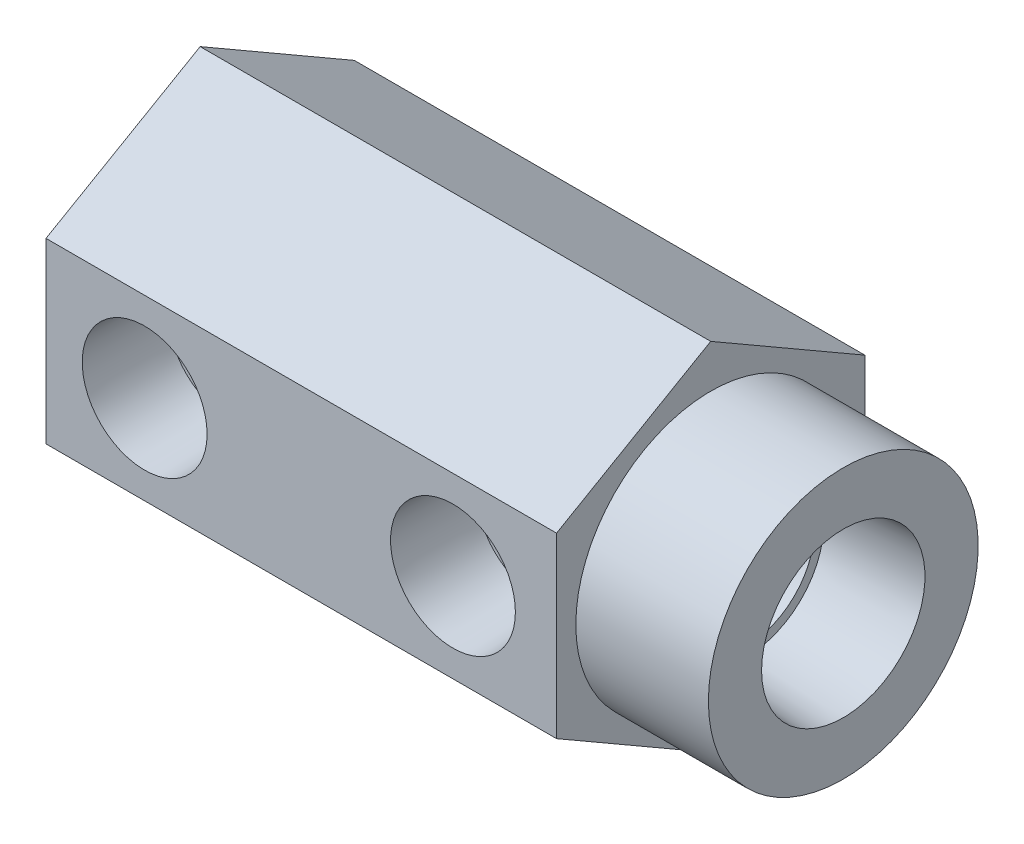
ISO-10303-21;
HEADER;
FILE_DESCRIPTION(('STEP AP214'),'2;1');
FILE_NAME('part.step','',(''),(''),'','','');
FILE_SCHEMA(('AUTOMOTIVE_DESIGN { 1 0 10303 214 1 1 1 1 }'));
ENDSEC;
DATA;
#1=APPLICATION_CONTEXT('core data for automotive mechanical design processes');
#2=APPLICATION_PROTOCOL_DEFINITION('international standard','automotive_design',2000,#1);
#3=PRODUCT_CONTEXT('',#1,'mechanical');
#4=PRODUCT('Part','Part','',(#3));
#5=PRODUCT_RELATED_PRODUCT_CATEGORY('part','',(#4));
#6=PRODUCT_DEFINITION_FORMATION('','',#4);
#7=PRODUCT_DEFINITION_CONTEXT('part definition',#1,'design');
#8=PRODUCT_DEFINITION('design','',#6,#7);
#9=PRODUCT_DEFINITION_SHAPE('','',#8);
#10=(LENGTH_UNIT() NAMED_UNIT(*) SI_UNIT(.MILLI.,.METRE.));
#11=(NAMED_UNIT(*) PLANE_ANGLE_UNIT() SI_UNIT($,.RADIAN.));
#12=(NAMED_UNIT(*) SI_UNIT($,.STERADIAN.) SOLID_ANGLE_UNIT());
#13=UNCERTAINTY_MEASURE_WITH_UNIT(LENGTH_MEASURE(1.E-05),#10,'distance_accuracy_value','');
#14=(GEOMETRIC_REPRESENTATION_CONTEXT(3) GLOBAL_UNCERTAINTY_ASSIGNED_CONTEXT((#13)) GLOBAL_UNIT_ASSIGNED_CONTEXT((#10,
#11,#12)) REPRESENTATION_CONTEXT('',''));
#15=CARTESIAN_POINT('',(0.,0.,0.));
#16=DIRECTION('',(0.,0.,1.));
#17=DIRECTION('',(1.,0.,0.));
#18=AXIS2_PLACEMENT_3D('',#15,#16,#17);
#19=CARTESIAN_POINT('',(52.9844,0.,0.));
#20=DIRECTION('',(1.,0.,0.));
#21=DIRECTION('',(0.,0.,-1.));
#22=AXIS2_PLACEMENT_3D('',#19,#20,#21);
#23=CYLINDRICAL_SURFACE('',#22,3.17499999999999);
#24=CARTESIAN_POINT('',(21.2344,0.,0.));
#25=DIRECTION('',(1.,0.,0.));
#26=DIRECTION('',(0.,0.,-1.));
#27=AXIS2_PLACEMENT_3D('',#24,#25,#26);
#28=CIRCLE('',#27,3.17499999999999);
#29=CARTESIAN_POINT('',(21.2344,0.,-3.17499999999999));
#30=VERTEX_POINT('',#29);
#31=EDGE_CURVE('E144',#30,#30,#28,.T.);
#32=ORIENTED_EDGE('',*,*,#31,.F.);
#33=EDGE_LOOP('',(#32));
#34=FACE_BOUND('',#33,.T.);
#35=CARTESIAN_POINT('',(27.5844,0.,0.));
#36=DIRECTION('',(1.,0.,0.));
#37=DIRECTION('',(0.,0.,-1.));
#38=AXIS2_PLACEMENT_3D('',#35,#36,#37);
#39=CIRCLE('',#38,3.17499999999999);
#40=CARTESIAN_POINT('',(27.5844,0.,-3.17499999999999));
#41=VERTEX_POINT('',#40);
#42=EDGE_CURVE('E38',#41,#41,#39,.F.);
#43=ORIENTED_EDGE('',*,*,#42,.F.);
#44=EDGE_LOOP('',(#43));
#45=FACE_BOUND('',#44,.T.);
#46=ADVANCED_FACE('F34',(#34,#45),#23,.F.);
#47=CARTESIAN_POINT('',(33.528,0.,12.7));
#48=DIRECTION('',(0.,0.,1.));
#49=DIRECTION('',(1.,0.,0.));
#50=AXIS2_PLACEMENT_3D('',#47,#48,#49);
#51=CYLINDRICAL_SURFACE('',#50,4.2164);
#52=CARTESIAN_POINT('',(33.528,0.,5.77596));
#53=DIRECTION('',(0.,0.,1.));
#54=DIRECTION('',(1.,0.,0.));
#55=AXIS2_PLACEMENT_3D('',#52,#53,#54);
#56=CIRCLE('',#55,4.2164);
#57=CARTESIAN_POINT('',(37.7444,0.,5.77596));
#58=VERTEX_POINT('',#57);
#59=EDGE_CURVE('E282',#58,#58,#56,.T.);
#60=ORIENTED_EDGE('',*,*,#59,.T.);
#61=EDGE_LOOP('',(#60));
#62=FACE_BOUND('',#61,.T.);
#63=CARTESIAN_POINT('',(37.7444,0.,5.54990000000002));
#64=CARTESIAN_POINT('',(37.7443993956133,0.102666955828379,5.54989942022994));
#65=CARTESIAN_POINT('',(37.7406438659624,0.205343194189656,5.54704470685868));
#66=CARTESIAN_POINT('',(37.7256842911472,0.409877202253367,5.53569249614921));
#67=CARTESIAN_POINT('',(37.7144766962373,0.511734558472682,5.52719230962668));
#68=CARTESIAN_POINT('',(37.6847756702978,0.713930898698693,5.50472974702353));
#69=CARTESIAN_POINT('',(37.6662712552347,0.814267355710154,5.49075913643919));
#70=CARTESIAN_POINT('',(37.6222775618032,1.01254840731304,5.45767930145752));
#71=CARTESIAN_POINT('',(37.5967851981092,1.11049192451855,5.43856780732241));
#72=CARTESIAN_POINT('',(37.5107274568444,1.398497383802,5.37438339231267));
#73=CARTESIAN_POINT('',(37.440361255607,1.58418379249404,5.32229076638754));
#74=CARTESIAN_POINT('',(37.276841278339,1.93974746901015,5.2032718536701));
#75=CARTESIAN_POINT('',(37.1836912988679,2.10962736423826,5.1363480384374));
#76=CARTESIAN_POINT('',(36.9680945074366,2.44693461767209,4.98509307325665));
#77=CARTESIAN_POINT('',(36.8437265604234,2.61265837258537,4.89972096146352));
#78=CARTESIAN_POINT('',(36.5743774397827,2.92229860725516,4.72159970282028));
#79=CARTESIAN_POINT('',(36.4293655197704,3.06618188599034,4.62883964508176));
#80=CARTESIAN_POINT('',(36.1818679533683,3.27873581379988,4.47894046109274));
#81=CARTESIAN_POINT('',(36.0852396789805,3.35465016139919,4.4222195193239));
#82=CARTESIAN_POINT('',(35.8853172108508,3.49803153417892,4.30969399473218));
#83=CARTESIAN_POINT('',(35.7820209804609,3.56549595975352,4.25388969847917));
#84=CARTESIAN_POINT('',(35.5689644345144,3.69158445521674,4.14494021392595));
#85=CARTESIAN_POINT('',(35.459210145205,3.75021659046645,4.091792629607));
#86=CARTESIAN_POINT('',(35.2332788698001,3.85820397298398,3.99013143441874));
#87=CARTESIAN_POINT('',(35.1171056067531,3.90756452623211,3.94161518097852));
#88=CARTESIAN_POINT('',(34.8423535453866,4.00972513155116,3.83800214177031));
#89=CARTESIAN_POINT('',(34.6815147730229,4.05910874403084,3.78530268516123));
#90=CARTESIAN_POINT('',(34.4334747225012,4.11890503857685,3.71979682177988));
#91=CARTESIAN_POINT('',(34.3497154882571,4.13645117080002,3.70022626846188));
#92=CARTESIAN_POINT('',(34.1802742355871,4.16652842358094,3.66632583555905));
#93=CARTESIAN_POINT('',(34.0945932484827,4.17906216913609,3.65199321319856));
#94=CARTESIAN_POINT('',(33.9209530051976,4.19896788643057,3.62908998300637));
#95=CARTESIAN_POINT('',(33.8329793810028,4.2062854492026,3.62058014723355));
#96=CARTESIAN_POINT('',(33.6563570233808,4.2153732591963,3.60999553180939));
#97=CARTESIAN_POINT('',(33.5677083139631,4.21714370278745,3.60792052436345));
#98=CARTESIAN_POINT('',(33.3905433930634,4.21508975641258,3.61032018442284));
#99=CARTESIAN_POINT('',(33.3020272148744,4.21126414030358,3.61479628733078));
#100=CARTESIAN_POINT('',(33.1259748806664,4.1981195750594,3.63005192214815));
#101=CARTESIAN_POINT('',(33.038438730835,4.18880059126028,3.64083149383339));
#102=CARTESIAN_POINT('',(32.7985166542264,4.15568903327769,3.67868158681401));
#103=CARTESIAN_POINT('',(32.6478348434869,4.1262776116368,3.71190594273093));
#104=CARTESIAN_POINT('',(32.3540921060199,4.05253036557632,3.79227022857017));
#105=CARTESIAN_POINT('',(32.211039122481,4.00817932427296,3.83942434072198));
#106=CARTESIAN_POINT('',(31.9583831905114,3.91523448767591,3.93394303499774));
#107=CARTESIAN_POINT('',(31.847374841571,3.86881960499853,3.97976043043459));
#108=CARTESIAN_POINT('',(31.6311954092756,3.7675481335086,4.07576238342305));
#109=CARTESIAN_POINT('',(31.5260274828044,3.71268703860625,4.12594926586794));
#110=CARTESIAN_POINT('',(31.3214051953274,3.5948485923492,4.22901830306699));
#111=CARTESIAN_POINT('',(31.2219633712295,3.53185434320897,4.28190592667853));
#112=CARTESIAN_POINT('',(31.0290973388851,3.39812936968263,4.38878526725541));
#113=CARTESIAN_POINT('',(30.9356721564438,3.32739990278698,4.44277680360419));
#114=CARTESIAN_POINT('',(30.7523590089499,3.17621734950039,4.55214005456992));
#115=CARTESIAN_POINT('',(30.662649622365,3.09554338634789,4.60750688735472));
#116=CARTESIAN_POINT('',(30.4900225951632,2.92631985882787,4.7168012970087));
#117=CARTESIAN_POINT('',(30.4071076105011,2.83776724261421,4.77072830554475));
#118=CARTESIAN_POINT('',(30.1695373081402,2.56081846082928,4.92833957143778));
#119=CARTESIAN_POINT('',(30.0255232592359,2.36069403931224,5.02818332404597));
#120=CARTESIAN_POINT('',(29.79622654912,1.97290355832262,5.19079382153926));
#121=CARTESIAN_POINT('',(29.704976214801,1.79022627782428,5.25699864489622));
#122=CARTESIAN_POINT('',(29.5877201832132,1.50428240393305,5.34307696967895));
#123=CARTESIAN_POINT('',(29.5518975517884,1.40695118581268,5.36957042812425));
#124=CARTESIAN_POINT('',(29.487255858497,1.20882529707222,5.41761054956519));
#125=CARTESIAN_POINT('',(29.4584337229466,1.10803216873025,5.43915938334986));
#126=CARTESIAN_POINT('',(29.4080388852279,0.902877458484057,5.47696644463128));
#127=CARTESIAN_POINT('',(29.3865198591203,0.798495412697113,5.49318547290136));
#128=CARTESIAN_POINT('',(29.3513945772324,0.587711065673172,5.5197156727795));
#129=CARTESIAN_POINT('',(29.3377846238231,0.481309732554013,5.53002960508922));
#130=CARTESIAN_POINT('',(29.3187165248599,0.267379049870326,5.54449183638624));
#131=CARTESIAN_POINT('',(29.3132569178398,0.159849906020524,5.54864124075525));
#132=CARTESIAN_POINT('',(29.31059043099,-0.0553630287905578,5.55066695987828));
#133=CARTESIAN_POINT('',(29.3133828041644,-0.163046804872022,5.54854384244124));
#134=CARTESIAN_POINT('',(29.3264157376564,-0.365919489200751,5.53865106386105));
#135=CARTESIAN_POINT('',(29.3358141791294,-0.461194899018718,5.5315198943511));
#136=CARTESIAN_POINT('',(29.3609746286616,-0.65042738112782,5.51247648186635));
#137=CARTESIAN_POINT('',(29.3767386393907,-0.744384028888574,5.50056273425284));
#138=CARTESIAN_POINT('',(29.4332697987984,-1.02327908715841,5.4579792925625));
#139=CARTESIAN_POINT('',(29.4832871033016,-1.20540685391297,5.42045882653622));
#140=CARTESIAN_POINT('',(29.6070842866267,-1.56242729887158,5.32871242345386));
#141=CARTESIAN_POINT('',(29.6814572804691,-1.73700152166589,5.27407116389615));
#142=CARTESIAN_POINT('',(29.8505450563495,-2.07109183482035,5.15204916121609));
#143=CARTESIAN_POINT('',(29.9452628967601,-2.23060565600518,5.08466650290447));
#144=CARTESIAN_POINT('',(30.1694079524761,-2.55802504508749,4.92909083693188));
#145=CARTESIAN_POINT('',(30.3019810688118,-2.72300325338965,4.83929765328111));
#146=CARTESIAN_POINT('',(30.5883037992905,-3.02991540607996,4.65330404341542));
#147=CARTESIAN_POINT('',(30.7420960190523,-3.17180170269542,4.55709093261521));
#148=CARTESIAN_POINT('',(31.0034639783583,-3.3794070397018,4.40345363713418));
#149=CARTESIAN_POINT('',(31.1049126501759,-3.45288781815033,4.34591141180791));
#150=CARTESIAN_POINT('',(31.314685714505,-3.5909673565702,4.23253042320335));
#151=CARTESIAN_POINT('',(31.4230125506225,-3.65556293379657,4.17669227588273));
#152=CARTESIAN_POINT('',(31.6462598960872,-3.7753266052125,4.06875742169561));
#153=CARTESIAN_POINT('',(31.7611678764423,-3.83051186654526,4.01665400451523));
#154=CARTESIAN_POINT('',(31.9975785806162,-3.93094643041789,3.91841531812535));
#155=CARTESIAN_POINT('',(32.1190762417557,-3.97620322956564,3.87227555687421));
#156=CARTESIAN_POINT('',(32.3974988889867,-4.06520982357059,3.77896121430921));
#157=CARTESIAN_POINT('',(32.5561211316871,-4.10619306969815,3.7340128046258));
#158=CARTESIAN_POINT('',(32.7996105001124,-4.15383268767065,3.68070998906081));
#159=CARTESIAN_POINT('',(32.8816471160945,-4.16740255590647,3.66530086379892));
#160=CARTESIAN_POINT('',(33.0471718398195,-4.18972486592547,3.63976459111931));
#161=CARTESIAN_POINT('',(33.1306592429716,-4.19847958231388,3.62963494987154));
#162=CARTESIAN_POINT('',(33.2991320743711,-4.21103758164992,3.61505835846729));
#163=CARTESIAN_POINT('',(33.3841240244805,-4.21480358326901,3.6106542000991));
#164=CARTESIAN_POINT('',(33.5542775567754,-4.21717640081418,3.60788260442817));
#165=CARTESIAN_POINT('',(33.639439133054,-4.21578339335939,3.60951496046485));
#166=CARTESIAN_POINT('',(33.8092521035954,-4.20786839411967,3.61873867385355));
#167=CARTESIAN_POINT('',(33.8939031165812,-4.20134295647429,3.62633403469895));
#168=CARTESIAN_POINT('',(34.0620056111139,-4.18330254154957,3.64713005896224));
#169=CARTESIAN_POINT('',(34.1454564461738,-4.17178497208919,3.66033363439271));
#170=CARTESIAN_POINT('',(34.3240534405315,-4.1417155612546,3.69434379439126));
#171=CARTESIAN_POINT('',(34.4188890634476,-4.12232321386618,3.71603879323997));
#172=CARTESIAN_POINT('',(34.6056232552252,-4.07749843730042,3.7651699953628));
#173=CARTESIAN_POINT('',(34.697519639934,-4.05206162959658,3.79261035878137));
#174=CARTESIAN_POINT('',(34.9685718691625,-3.96719813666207,3.88193715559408));
#175=CARTESIAN_POINT('',(35.1428493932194,-3.89926066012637,3.95077814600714));
#176=CARTESIAN_POINT('',(35.426054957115,-3.76720881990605,4.07616702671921));
#177=CARTESIAN_POINT('',(35.5387046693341,-3.70824622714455,4.13006200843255));
#178=CARTESIAN_POINT('',(35.7572672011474,-3.5811127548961,4.24076863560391));
#179=CARTESIAN_POINT('',(35.8631775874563,-3.51293857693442,4.29758132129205));
#180=CARTESIAN_POINT('',(36.0681950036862,-3.36767607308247,4.41233843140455));
#181=CARTESIAN_POINT('',(36.167295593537,-3.29057948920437,4.47028386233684));
#182=CARTESIAN_POINT('',(36.3583871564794,-3.12772920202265,4.58570164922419));
#183=CARTESIAN_POINT('',(36.450379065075,-3.04197664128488,4.64317406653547));
#184=CARTESIAN_POINT('',(36.6281804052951,-2.86064113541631,4.75707411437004));
#185=CARTESIAN_POINT('',(36.7138800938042,-2.76493305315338,4.81347428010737));
#186=CARTESIAN_POINT('',(36.8770160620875,-2.56491197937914,4.9229681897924));
#187=CARTESIAN_POINT('',(36.954451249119,-2.46059785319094,4.9760614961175));
#188=CARTESIAN_POINT('',(37.100127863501,-2.24386878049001,5.07747289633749));
#189=CARTESIAN_POINT('',(37.1683863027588,-2.13146943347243,5.12579978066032));
#190=CARTESIAN_POINT('',(37.29491910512,-1.89890802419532,5.21642520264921));
#191=CARTESIAN_POINT('',(37.3531981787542,-1.77874966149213,5.25872658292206));
#192=CARTESIAN_POINT('',(37.4439058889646,-1.56622364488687,5.32513054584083));
#193=CARTESIAN_POINT('',(37.4789964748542,-1.47553606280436,5.35100662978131));
#194=CARTESIAN_POINT('',(37.5430944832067,-1.29096184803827,5.39850728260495));
#195=CARTESIAN_POINT('',(37.5721033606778,-1.19707598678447,5.420132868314));
#196=CARTESIAN_POINT('',(37.6236159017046,-1.00680382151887,5.4586756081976));
#197=CARTESIAN_POINT('',(37.6461329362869,-0.910423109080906,5.47560243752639));
#198=CARTESIAN_POINT('',(37.6844114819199,-0.715624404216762,5.50444899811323));
#199=CARTESIAN_POINT('',(37.700175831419,-0.61720728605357,5.5163708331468));
#200=CARTESIAN_POINT('',(37.7230526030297,-0.432452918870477,5.53369497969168));
#201=CARTESIAN_POINT('',(37.7310480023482,-0.34628607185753,5.53976185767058));
#202=CARTESIAN_POINT('',(37.7417225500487,-0.173415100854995,5.54786506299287));
#203=CARTESIAN_POINT('',(37.7444005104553,-0.0867108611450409,5.54990048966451));
#204=CARTESIAN_POINT('',(37.7444,0.,5.54990000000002));
#205=B_SPLINE_CURVE_WITH_KNOTS('',3,(#63,#64,#65,#66,#67,#68,#69,#70,#71,#72,#73,#74,#75,#76,
#77,#78,#79,#80,#81,#82,#83,#84,#85,#86,#87,#88,#89,#90,#91,#92,#93,#94,#95,#96,#97,#98,#99,
#100,#101,#102,#103,#104,#105,#106,#107,#108,#109,#110,#111,#112,#113,#114,#115,#116,#117,#118,
#119,#120,#121,#122,#123,#124,#125,#126,#127,#128,#129,#130,#131,#132,#133,#134,#135,#136,#137,
#138,#139,#140,#141,#142,#143,#144,#145,#146,#147,#148,#149,#150,#151,#152,#153,#154,#155,#156,
#157,#158,#159,#160,#161,#162,#163,#164,#165,#166,#167,#168,#169,#170,#171,#172,#173,#174,#175,
#176,#177,#178,#179,#180,#181,#182,#183,#184,#185,#186,#187,#188,#189,#190,#191,#192,#193,#194,
#195,#196,#197,#198,#199,#200,#201,#202,#203,#204),.UNSPECIFIED.,.T.,.F.,(4,2,2,2,2,2,2,2,2,2,2,
2,2,2,2,2,2,2,2,2,2,2,2,2,2,2,2,2,2,2,2,2,2,2,2,2,2,2,2,2,2,2,2,2,2,2,2,2,2,2,2,2,2,2,2,2,2,2,2,
2,2,2,2,2,2,2,2,2,2,2,4),(0.,0.307909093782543,0.615964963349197,0.924486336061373,
1.23314414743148,1.84608968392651,2.45893315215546,3.12888302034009,3.79984133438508,
4.20549409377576,4.61127134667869,5.01667578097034,5.42184749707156,5.94866107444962,
6.21175949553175,6.47471995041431,6.74038467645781,7.00603999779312,7.2717535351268,
7.53746874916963,8.00678580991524,8.47658235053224,8.86232249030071,9.24826914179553,
9.63503095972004,10.0217299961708,10.4195319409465,10.817488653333,11.6111347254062,
12.2523588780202,12.5731486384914,12.8937972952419,13.2167540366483,13.5395596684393,
13.8623074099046,14.1850259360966,14.4726847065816,14.7604340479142,15.3354443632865,
15.925652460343,16.5159493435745,17.2032337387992,17.891918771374,18.3050679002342,
18.7183646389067,19.1308991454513,19.543121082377,20.0506303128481,20.3040712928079,
20.5573924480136,20.8125962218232,21.0677912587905,21.323157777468,21.5786570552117,
21.8757972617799,22.1731533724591,22.7686074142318,23.1824806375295,23.5965024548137,
24.0109105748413,24.4252640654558,24.8456610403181,25.266113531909,25.6857755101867,
26.1052388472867,26.4068178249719,26.7083245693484,27.0092058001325,27.3099604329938,
27.5699574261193,27.8300124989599),.UNSPECIFIED.);
#206=CARTESIAN_POINT('',(37.7444,0.,5.54990000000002));
#207=VERTEX_POINT('',#206);
#208=EDGE_CURVE('E155',#207,#207,#205,.T.);
#209=ORIENTED_EDGE('',*,*,#208,.F.);
#210=EDGE_LOOP('',(#209));
#211=FACE_BOUND('',#210,.T.);
#212=ADVANCED_FACE('F186',(#62,#211),#51,.F.);
#213=CARTESIAN_POINT('',(52.9844,0.,0.));
#214=DIRECTION('',(1.,0.,0.));
#215=DIRECTION('',(0.,0.,-1.));
#216=AXIS2_PLACEMENT_3D('',#213,#214,#215);
#217=PLANE('',#216);
#218=CARTESIAN_POINT('',(52.9844,0.,0.));
#219=DIRECTION('',(1.,0.,0.));
#220=DIRECTION('',(0.,0.,-1.));
#221=AXIS2_PLACEMENT_3D('',#218,#219,#220);
#222=CIRCLE('',#221,11.1125);
#223=CARTESIAN_POINT('',(52.9844,0.,11.1125));
#224=VERTEX_POINT('',#223);
#225=EDGE_CURVE('E275',#224,#224,#222,.T.);
#226=ORIENTED_EDGE('',*,*,#225,.T.);
#227=EDGE_LOOP('',(#226));
#228=FACE_BOUND('',#227,.T.);
#229=CARTESIAN_POINT('',(52.9844,0.,0.));
#230=DIRECTION('',(-1.,0.,0.));
#231=DIRECTION('',(0.,0.,1.));
#232=AXIS2_PLACEMENT_3D('',#229,#230,#231);
#233=CIRCLE('',#232,6.73100000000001);
#234=CARTESIAN_POINT('',(52.9844,0.,6.73100000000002));
#235=VERTEX_POINT('',#234);
#236=EDGE_CURVE('E307',#235,#235,#233,.T.);
#237=ORIENTED_EDGE('',*,*,#236,.T.);
#238=EDGE_LOOP('',(#237));
#239=FACE_BOUND('',#238,.T.);
#240=ADVANCED_FACE('F229',(#228,#239),#217,.T.);
#241=CARTESIAN_POINT('',(21.2344,0.,0.));
#242=DIRECTION('',(1.,0.,0.));
#243=DIRECTION('',(0.,0.,-1.));
#244=AXIS2_PLACEMENT_3D('',#241,#242,#243);
#245=CONICAL_SURFACE('',#244,3.17499999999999,1.02974425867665);
#246=CARTESIAN_POINT('',(20.9959334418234,0.,0.));
#247=DIRECTION('',(1.,0.,0.));
#248=DIRECTION('',(0.,0.,-1.));
#249=AXIS2_PLACEMENT_3D('',#246,#247,#248);
#250=CIRCLE('',#249,2.77812499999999);
#251=CARTESIAN_POINT('',(20.9959334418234,0.,-2.77812499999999));
#252=VERTEX_POINT('',#251);
#253=EDGE_CURVE('E141',#252,#252,#250,.F.);
#254=ORIENTED_EDGE('',*,*,#253,.T.);
#255=EDGE_LOOP('',(#254));
#256=FACE_BOUND('',#255,.T.);
#257=ORIENTED_EDGE('',*,*,#31,.T.);
#258=EDGE_LOOP('',(#257));
#259=FACE_BOUND('',#258,.T.);
#260=ADVANCED_FACE('F234',(#256,#259),#245,.F.);
#261=CARTESIAN_POINT('',(52.9844,0.,0.));
#262=DIRECTION('',(1.,0.,0.));
#263=DIRECTION('',(0.,0.,-1.));
#264=AXIS2_PLACEMENT_3D('',#261,#262,#263);
#265=CYLINDRICAL_SURFACE('',#264,2.77812499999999);
#266=CARTESIAN_POINT('',(12.3444,0.,-2.77812499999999));
#267=CARTESIAN_POINT('',(12.3443955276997,-0.139883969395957,-2.77811997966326));
#268=CARTESIAN_POINT('',(12.3373755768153,-0.279800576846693,-2.76749868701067));
#269=CARTESIAN_POINT('',(12.3099836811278,-0.555187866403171,-2.72565235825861));
#270=CARTESIAN_POINT('',(12.2896031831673,-0.6906556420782,-2.69441412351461));
#271=CARTESIAN_POINT('',(12.2375104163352,-0.952754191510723,-2.61323304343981));
#272=CARTESIAN_POINT('',(12.2058514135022,-1.07942321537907,-2.56337806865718));
#273=CARTESIAN_POINT('',(12.1337605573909,-1.32210407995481,-2.44706908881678));
#274=CARTESIAN_POINT('',(12.0933275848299,-1.4381145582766,-2.38061296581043));
#275=CARTESIAN_POINT('',(12.0029110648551,-1.66718281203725,-2.22689910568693));
#276=CARTESIAN_POINT('',(11.9524106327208,-1.77917454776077,-2.13836318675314));
#277=CARTESIAN_POINT('',(11.8482905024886,-1.98773409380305,-1.94603559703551));
#278=CARTESIAN_POINT('',(11.7946664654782,-2.08427971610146,-1.84222238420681));
#279=CARTESIAN_POINT('',(11.680384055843,-2.27435151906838,-1.60375038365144));
#280=CARTESIAN_POINT('',(11.6199096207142,-2.36513867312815,-1.46680289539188));
#281=CARTESIAN_POINT('',(11.5081634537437,-2.52226630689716,-1.17614753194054));
#282=CARTESIAN_POINT('',(11.4568758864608,-2.58864906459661,-1.0224692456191));
#283=CARTESIAN_POINT('',(11.3845681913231,-2.6786449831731,-0.746661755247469));
#284=CARTESIAN_POINT('',(11.3590896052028,-2.70904686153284,-0.627927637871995));
#285=CARTESIAN_POINT('',(11.3208802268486,-2.75398593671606,-0.385574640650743));
#286=CARTESIAN_POINT('',(11.3081282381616,-2.76854951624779,-0.261964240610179));
#287=CARTESIAN_POINT('',(11.2973346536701,-2.78090423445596,-0.0127670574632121));
#288=CARTESIAN_POINT('',(11.299348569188,-2.77863208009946,0.112825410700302));
#289=CARTESIAN_POINT('',(11.3178791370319,-2.75733196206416,0.361533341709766));
#290=CARTESIAN_POINT('',(11.3344080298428,-2.73828985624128,0.484646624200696));
#291=CARTESIAN_POINT('',(11.3785253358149,-2.68574292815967,0.720261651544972));
#292=CARTESIAN_POINT('',(11.405649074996,-2.65284171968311,0.832990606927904));
#293=CARTESIAN_POINT('',(11.4678512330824,-2.57408907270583,1.05144792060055));
#294=CARTESIAN_POINT('',(11.5029322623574,-2.52823338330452,1.15717396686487));
#295=CARTESIAN_POINT('',(11.5855849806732,-2.41433509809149,1.38122293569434));
#296=CARTESIAN_POINT('',(11.6342504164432,-2.34368656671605,1.49781446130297));
#297=CARTESIAN_POINT('',(11.7342078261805,-2.18677186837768,1.71883915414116));
#298=CARTESIAN_POINT('',(11.7855029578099,-2.10048659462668,1.82325718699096));
#299=CARTESIAN_POINT('',(11.8972440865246,-1.89401186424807,2.0389531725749));
#300=CARTESIAN_POINT('',(11.9574048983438,-1.77049887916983,2.14723280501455));
#301=CARTESIAN_POINT('',(12.0697093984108,-1.50393214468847,2.3416440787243));
#302=CARTESIAN_POINT('',(12.1218609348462,-1.360897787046,2.42779745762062));
#303=CARTESIAN_POINT('',(12.2035712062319,-1.08804954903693,2.55975410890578));
#304=CARTESIAN_POINT('',(12.2355572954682,-0.961193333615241,2.61016446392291));
#305=CARTESIAN_POINT('',(12.2881429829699,-0.699302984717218,2.69216201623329));
#306=CARTESIAN_POINT('',(12.3087520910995,-0.564275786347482,2.72376493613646));
#307=CARTESIAN_POINT('',(12.3367594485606,-0.289077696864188,2.76656311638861));
#308=CARTESIAN_POINT('',(12.3441045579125,-0.148888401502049,2.77767629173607));
#309=CARTESIAN_POINT('',(12.3446777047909,0.131592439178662,2.77854678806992));
#310=CARTESIAN_POINT('',(12.3379061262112,0.271883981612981,2.76830468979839));
#311=CARTESIAN_POINT('',(12.3118222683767,0.53898974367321,2.72846498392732));
#312=CARTESIAN_POINT('',(12.293354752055,0.666086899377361,2.70017031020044));
#313=CARTESIAN_POINT('',(12.2462164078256,0.913332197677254,2.62686914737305));
#314=CARTESIAN_POINT('',(12.2175439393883,1.03347921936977,2.58185997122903));
#315=CARTESIAN_POINT('',(12.1499536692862,1.27211922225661,2.47345398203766));
#316=CARTESIAN_POINT('',(12.1104913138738,1.38999773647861,2.40905262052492));
#317=CARTESIAN_POINT('',(12.0252151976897,1.61372348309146,2.26530005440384));
#318=CARTESIAN_POINT('',(11.9793972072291,1.7195626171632,2.18593888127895));
#319=CARTESIAN_POINT('',(11.8769809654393,1.93374575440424,2.00042955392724));
#320=CARTESIAN_POINT('',(11.819819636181,2.03987372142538,1.89203198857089));
#321=CARTESIAN_POINT('',(11.7060872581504,2.23336504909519,1.65921349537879));
#322=CARTESIAN_POINT('',(11.6495165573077,2.32071788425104,1.53478364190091));
#323=CARTESIAN_POINT('',(11.5483307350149,2.46707513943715,1.28464793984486));
#324=CARTESIAN_POINT('',(11.5030847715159,2.52806065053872,1.16036269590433));
#325=CARTESIAN_POINT('',(11.4230252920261,2.63156603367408,0.901230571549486));
#326=CARTESIAN_POINT('',(11.3881929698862,2.67411925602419,0.766403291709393));
#327=CARTESIAN_POINT('',(11.3387874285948,2.7331509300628,0.511839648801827));
#328=CARTESIAN_POINT('',(11.321811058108,2.75278516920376,0.393313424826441));
#329=CARTESIAN_POINT('',(11.3012384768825,2.77648205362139,0.153603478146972));
#330=CARTESIAN_POINT('',(11.2976297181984,2.78055930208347,0.0324223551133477));
#331=CARTESIAN_POINT('',(11.3043444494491,2.77288356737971,-0.209018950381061));
#332=CARTESIAN_POINT('',(11.3146671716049,2.76113145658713,-0.329279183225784));
#333=CARTESIAN_POINT('',(11.347667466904,2.7225709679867,-0.565663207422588));
#334=CARTESIAN_POINT('',(11.3703613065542,2.6957427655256,-0.681781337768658));
#335=CARTESIAN_POINT('',(11.4329033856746,2.61891416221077,-0.939151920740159));
#336=CARTESIAN_POINT('',(11.4757744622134,2.564531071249,-1.07834904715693));
#337=CARTESIAN_POINT('',(11.5704785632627,2.43592687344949,-1.34390911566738));
#338=CARTESIAN_POINT('',(11.6223239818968,2.36167825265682,-1.47025391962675));
#339=CARTESIAN_POINT('',(11.7301621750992,2.19375835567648,-1.71092773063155));
#340=CARTESIAN_POINT('',(11.7862104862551,2.09977824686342,-1.82501585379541));
#341=CARTESIAN_POINT('',(11.8966286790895,1.89448963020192,-2.03733294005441));
#342=CARTESIAN_POINT('',(11.9509980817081,1.78317623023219,-2.13555740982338));
#343=CARTESIAN_POINT('',(12.0599078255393,1.52949387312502,-2.32521006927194));
#344=CARTESIAN_POINT('',(12.1136453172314,1.38498877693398,-2.41431318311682));
#345=CARTESIAN_POINT('',(12.1837916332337,1.15543155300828,-2.52789646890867));
#346=CARTESIAN_POINT('',(12.205427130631,1.07679625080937,-2.5624074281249));
#347=CARTESIAN_POINT('',(12.2445786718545,0.915786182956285,-2.62426099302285));
#348=CARTESIAN_POINT('',(12.2620964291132,0.833412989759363,-2.6516065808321));
#349=CARTESIAN_POINT('',(12.2990312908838,0.628891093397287,-2.70889840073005));
#350=CARTESIAN_POINT('',(12.3159311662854,0.505095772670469,-2.73475594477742));
#351=CARTESIAN_POINT('',(12.3386147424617,0.254208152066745,-2.76936720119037));
#352=CARTESIAN_POINT('',(12.3444040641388,0.127117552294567,-2.77812956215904));
#353=CARTESIAN_POINT('',(12.3444,0.,-2.77812499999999));
#354=B_SPLINE_CURVE_WITH_KNOTS('',3,(#266,#267,#268,#269,#270,#271,#272,#273,#274,#275,#276,
#277,#278,#279,#280,#281,#282,#283,#284,#285,#286,#287,#288,#289,#290,#291,#292,#293,#294,#295,
#296,#297,#298,#299,#300,#301,#302,#303,#304,#305,#306,#307,#308,#309,#310,#311,#312,#313,#314,
#315,#316,#317,#318,#319,#320,#321,#322,#323,#324,#325,#326,#327,#328,#329,#330,#331,#332,#333,
#334,#335,#336,#337,#338,#339,#340,#341,#342,#343,#344,#345,#346,#347,#348,#349,#350,#351,#352,
#353),.UNSPECIFIED.,.T.,.F.,(4,2,2,2,2,2,2,2,2,2,2,2,2,2,2,2,2,2,2,2,2,2,2,2,2,2,2,2,2,2,2,2,2,
2,2,2,2,2,2,2,2,2,2,4),(0.,0.419152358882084,0.838573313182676,1.25603913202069,
1.67355823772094,2.12613857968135,2.57936331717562,3.10216790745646,3.62406247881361,
3.99811472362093,4.37154293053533,4.74637573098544,5.12152493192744,5.48179405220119,
5.84218152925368,6.27490955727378,6.70816995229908,7.23044654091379,7.75220804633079,
8.17104864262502,8.58953860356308,9.0097014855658,9.4298529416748,9.82266301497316,
10.2155362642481,10.6339311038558,11.0526057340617,11.5370187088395,12.0217025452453,
12.4570234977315,12.8915534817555,13.253952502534,13.6160112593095,13.9780500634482,
14.3405660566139,14.8044889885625,15.2690578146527,15.7415272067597,16.2141301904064,
16.744910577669,17.0101944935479,17.2753678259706,17.656459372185,18.0373580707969),.UNSPECIFIED.);
#355=CARTESIAN_POINT('',(12.3444,0.,-2.77812499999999));
#356=VERTEX_POINT('',#355);
#357=EDGE_CURVE('E146',#356,#356,#354,.T.);
#358=ORIENTED_EDGE('',*,*,#357,.T.);
#359=EDGE_LOOP('',(#358));
#360=FACE_BOUND('',#359,.T.);
#361=ORIENTED_EDGE('',*,*,#253,.F.);
#362=EDGE_LOOP('',(#361));
#363=FACE_BOUND('',#362,.T.);
#364=ADVANCED_FACE('F160',(#360,#363),#265,.F.);
#365=CARTESIAN_POINT('',(37.7444,0.,5.77596));
#366=DIRECTION('',(0.,0.,-1.));
#367=DIRECTION('',(-1.,0.,0.));
#368=AXIS2_PLACEMENT_3D('',#365,#366,#367);
#369=PLANE('',#368);
#370=ORIENTED_EDGE('',*,*,#59,.F.);
#371=EDGE_LOOP('',(#370));
#372=FACE_BOUND('',#371,.T.);
#373=CARTESIAN_POINT('',(33.528,0.,5.77596));
#374=DIRECTION('',(0.,0.,1.));
#375=DIRECTION('',(1.,0.,0.));
#376=AXIS2_PLACEMENT_3D('',#373,#374,#375);
#377=CIRCLE('',#376,4.93618496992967);
#378=CARTESIAN_POINT('',(38.4641849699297,0.,5.77596));
#379=VERTEX_POINT('',#378);
#380=EDGE_CURVE('E285',#379,#379,#377,.T.);
#381=ORIENTED_EDGE('',*,*,#380,.T.);
#382=EDGE_LOOP('',(#381));
#383=FACE_BOUND('',#382,.T.);
#384=ADVANCED_FACE('F177',(#372,#383),#369,.F.);
#385=CARTESIAN_POINT('',(33.528,0.,12.7));
#386=DIRECTION('',(0.,0.,1.));
#387=DIRECTION('',(1.,0.,0.));
#388=AXIS2_PLACEMENT_3D('',#385,#386,#387);
#389=CONICAL_SURFACE('',#388,5.1435,0.0299323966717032);
#390=ORIENTED_EDGE('',*,*,#380,.F.);
#391=EDGE_LOOP('',(#390));
#392=FACE_BOUND('',#391,.T.);
#393=CARTESIAN_POINT('',(33.528,0.,12.7));
#394=DIRECTION('',(0.,0.,1.));
#395=DIRECTION('',(1.,0.,0.));
#396=AXIS2_PLACEMENT_3D('',#393,#394,#395);
#397=CIRCLE('',#396,5.1435);
#398=CARTESIAN_POINT('',(38.6715,0.,12.7));
#399=VERTEX_POINT('',#398);
#400=EDGE_CURVE('E153',#399,#399,#397,.T.);
#401=ORIENTED_EDGE('',*,*,#400,.T.);
#402=EDGE_LOOP('',(#401));
#403=FACE_BOUND('',#402,.T.);
#404=ADVANCED_FACE('F173',(#392,#403),#389,.F.);
#405=CARTESIAN_POINT('',(42.0624,-14.6646968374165,0.));
#406=DIRECTION('',(0.,0.866025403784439,0.5));
#407=DIRECTION('',(0.,-0.5,0.866025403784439));
#408=AXIS2_PLACEMENT_3D('',#405,#406,#407);
#409=PLANE('',#408);
#410=DIRECTION('',(0.,0.5,-0.866025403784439));
#411=VECTOR('',#410,1.);
#412=CARTESIAN_POINT('',(0.,-14.6646968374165,0.));
#413=LINE('',#412,#411);
#414=CARTESIAN_POINT('',(0.,-14.6646968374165,0.));
#415=VERTEX_POINT('',#414);
#416=CARTESIAN_POINT('',(0.,-7.33234841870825,-12.7));
#417=VERTEX_POINT('',#416);
#418=EDGE_CURVE('E127',#415,#417,#413,.T.);
#419=ORIENTED_EDGE('',*,*,#418,.T.);
#420=DIRECTION('',(-1.,0.,0.));
#421=VECTOR('',#420,1.);
#422=CARTESIAN_POINT('',(42.0624,-7.33234841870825,-12.7));
#423=LINE('',#422,#421);
#424=CARTESIAN_POINT('',(42.0624,-7.33234841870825,-12.7));
#425=VERTEX_POINT('',#424);
#426=EDGE_CURVE('E44',#425,#417,#423,.T.);
#427=ORIENTED_EDGE('',*,*,#426,.F.);
#428=DIRECTION('',(0.,0.5,-0.866025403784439));
#429=VECTOR('',#428,1.);
#430=CARTESIAN_POINT('',(42.0624,-14.6646968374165,0.));
#431=LINE('',#430,#429);
#432=CARTESIAN_POINT('',(42.0624,-14.6646968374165,0.));
#433=VERTEX_POINT('',#432);
#434=EDGE_CURVE('E91',#433,#425,#431,.T.);
#435=ORIENTED_EDGE('',*,*,#434,.F.);
#436=DIRECTION('',(-1.,0.,0.));
#437=VECTOR('',#436,1.);
#438=CARTESIAN_POINT('',(42.0624,-14.6646968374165,0.));
#439=LINE('',#438,#437);
#440=EDGE_CURVE('E11',#433,#415,#439,.T.);
#441=ORIENTED_EDGE('',*,*,#440,.T.);
#442=EDGE_LOOP('',(#419,#427,#435,#441));
#443=FACE_BOUND('',#442,.T.);
#444=ADVANCED_FACE('F176',(#443),#409,.F.);
#445=CARTESIAN_POINT('',(42.0624,-7.33234841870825,-12.7));
#446=DIRECTION('',(0.,0.,1.));
#447=DIRECTION('',(1.,0.,0.));
#448=AXIS2_PLACEMENT_3D('',#445,#446,#447);
#449=PLANE('',#448);
#450=CARTESIAN_POINT('',(8.128,0.,-12.7));
#451=DIRECTION('',(0.,0.,-1.));
#452=DIRECTION('',(-1.,0.,0.));
#453=AXIS2_PLACEMENT_3D('',#450,#451,#452);
#454=CIRCLE('',#453,5.1435);
#455=CARTESIAN_POINT('',(2.9845,0.,-12.7));
#456=VERTEX_POINT('',#455);
#457=EDGE_CURVE('E304',#456,#456,#454,.T.);
#458=ORIENTED_EDGE('',*,*,#457,.F.);
#459=EDGE_LOOP('',(#458));
#460=FACE_BOUND('',#459,.T.);
#461=DIRECTION('',(0.,1.,0.));
#462=VECTOR('',#461,1.);
#463=CARTESIAN_POINT('',(0.,-7.33234841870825,-12.7));
#464=LINE('',#463,#462);
#465=CARTESIAN_POINT('',(0.,7.33234841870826,-12.7));
#466=VERTEX_POINT('',#465);
#467=EDGE_CURVE('E130',#417,#466,#464,.T.);
#468=ORIENTED_EDGE('',*,*,#467,.T.);
#469=DIRECTION('',(-1.,0.,0.));
#470=VECTOR('',#469,1.);
#471=CARTESIAN_POINT('',(42.0624,7.33234841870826,-12.7));
#472=LINE('',#471,#470);
#473=CARTESIAN_POINT('',(42.0624,7.33234841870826,-12.7));
#474=VERTEX_POINT('',#473);
#475=EDGE_CURVE('E115',#474,#466,#472,.T.);
#476=ORIENTED_EDGE('',*,*,#475,.F.);
#477=DIRECTION('',(0.,1.,0.));
#478=VECTOR('',#477,1.);
#479=CARTESIAN_POINT('',(42.0624,-7.33234841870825,-12.7));
#480=LINE('',#479,#478);
#481=EDGE_CURVE('E106',#425,#474,#480,.T.);
#482=ORIENTED_EDGE('',*,*,#481,.F.);
#483=ORIENTED_EDGE('',*,*,#426,.T.);
#484=EDGE_LOOP('',(#468,#476,#482,#483));
#485=FACE_BOUND('',#484,.T.);
#486=ADVANCED_FACE('F258',(#460,#485),#449,.F.);
#487=CARTESIAN_POINT('',(42.0624,7.33234841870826,-12.7));
#488=DIRECTION('',(0.,-0.866025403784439,0.5));
#489=DIRECTION('',(0.,-0.5,-0.866025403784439));
#490=AXIS2_PLACEMENT_3D('',#487,#488,#489);
#491=PLANE('',#490);
#492=DIRECTION('',(0.,0.5,0.866025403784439));
#493=VECTOR('',#492,1.);
#494=CARTESIAN_POINT('',(0.,7.33234841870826,-12.7));
#495=LINE('',#494,#493);
#496=CARTESIAN_POINT('',(0.,14.6646968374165,0.));
#497=VERTEX_POINT('',#496);
#498=EDGE_CURVE('E114',#466,#497,#495,.T.);
#499=ORIENTED_EDGE('',*,*,#498,.T.);
#500=DIRECTION('',(-1.,0.,0.));
#501=VECTOR('',#500,1.);
#502=CARTESIAN_POINT('',(42.0624,14.6646968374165,0.));
#503=LINE('',#502,#501);
#504=CARTESIAN_POINT('',(42.0624,14.6646968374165,0.));
#505=VERTEX_POINT('',#504);
#506=EDGE_CURVE('E111',#505,#497,#503,.T.);
#507=ORIENTED_EDGE('',*,*,#506,.F.);
#508=DIRECTION('',(0.,0.5,0.866025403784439));
#509=VECTOR('',#508,1.);
#510=CARTESIAN_POINT('',(42.0624,7.33234841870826,-12.7));
#511=LINE('',#510,#509);
#512=EDGE_CURVE('E99',#474,#505,#511,.T.);
#513=ORIENTED_EDGE('',*,*,#512,.F.);
#514=ORIENTED_EDGE('',*,*,#475,.T.);
#515=EDGE_LOOP('',(#499,#507,#513,#514));
#516=FACE_BOUND('',#515,.T.);
#517=ADVANCED_FACE('F112',(#516),#491,.F.);
#518=CARTESIAN_POINT('',(42.0624,14.6646968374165,0.));
#519=DIRECTION('',(0.,-0.866025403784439,-0.5));
#520=DIRECTION('',(0.,0.5,-0.866025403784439));
#521=AXIS2_PLACEMENT_3D('',#518,#519,#520);
#522=PLANE('',#521);
#523=DIRECTION('',(0.,-0.5,0.866025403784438));
#524=VECTOR('',#523,1.);
#525=CARTESIAN_POINT('',(0.,14.6646968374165,0.));
#526=LINE('',#525,#524);
#527=CARTESIAN_POINT('',(0.,7.33234841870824,12.7));
#528=VERTEX_POINT('',#527);
#529=EDGE_CURVE('E77',#497,#528,#526,.T.);
#530=ORIENTED_EDGE('',*,*,#529,.T.);
#531=DIRECTION('',(-1.,0.,0.));
#532=VECTOR('',#531,1.);
#533=CARTESIAN_POINT('',(42.0624,7.33234841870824,12.7));
#534=LINE('',#533,#532);
#535=CARTESIAN_POINT('',(42.0624,7.33234841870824,12.7));
#536=VERTEX_POINT('',#535);
#537=EDGE_CURVE('E116',#536,#528,#534,.T.);
#538=ORIENTED_EDGE('',*,*,#537,.F.);
#539=DIRECTION('',(0.,-0.5,0.866025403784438));
#540=VECTOR('',#539,1.);
#541=CARTESIAN_POINT('',(42.0624,14.6646968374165,0.));
#542=LINE('',#541,#540);
#543=EDGE_CURVE('E104',#505,#536,#542,.T.);
#544=ORIENTED_EDGE('',*,*,#543,.F.);
#545=ORIENTED_EDGE('',*,*,#506,.T.);
#546=EDGE_LOOP('',(#530,#538,#544,#545));
#547=FACE_BOUND('',#546,.T.);
#548=ADVANCED_FACE('F118',(#547),#522,.F.);
#549=CARTESIAN_POINT('',(42.0624,-14.6646968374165,0.));
#550=DIRECTION('',(1.,0.,0.));
#551=DIRECTION('',(0.,0.,-1.));
#552=AXIS2_PLACEMENT_3D('',#549,#550,#551);
#553=PLANE('',#552);
#554=DIRECTION('',(0.,-0.5,-0.866025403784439));
#555=VECTOR('',#554,1.);
#556=CARTESIAN_POINT('',(42.0624,-7.33234841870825,12.7));
#557=LINE('',#556,#555);
#558=CARTESIAN_POINT('',(42.0624,-7.33234841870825,12.7));
#559=VERTEX_POINT('',#558);
#560=EDGE_CURVE('E135',#559,#433,#557,.T.);
#561=ORIENTED_EDGE('',*,*,#560,.T.);
#562=ORIENTED_EDGE('',*,*,#434,.T.);
#563=ORIENTED_EDGE('',*,*,#481,.T.);
#564=ORIENTED_EDGE('',*,*,#512,.T.);
#565=ORIENTED_EDGE('',*,*,#543,.T.);
#566=DIRECTION('',(0.,-1.,0.));
#567=VECTOR('',#566,1.);
#568=CARTESIAN_POINT('',(42.0624,7.33234841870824,12.7));
#569=LINE('',#568,#567);
#570=EDGE_CURVE('E53',#536,#559,#569,.T.);
#571=ORIENTED_EDGE('',*,*,#570,.T.);
#572=EDGE_LOOP('',(#561,#562,#563,#564,#565,#571));
#573=FACE_BOUND('',#572,.T.);
#574=CARTESIAN_POINT('',(42.0624,0.,0.));
#575=DIRECTION('',(1.,0.,0.));
#576=DIRECTION('',(0.,0.,-1.));
#577=AXIS2_PLACEMENT_3D('',#574,#575,#576);
#578=CIRCLE('',#577,11.1125);
#579=CARTESIAN_POINT('',(42.0624,0.,11.1125));
#580=VERTEX_POINT('',#579);
#581=EDGE_CURVE('E128',#580,#580,#578,.F.);
#582=ORIENTED_EDGE('',*,*,#581,.T.);
#583=EDGE_LOOP('',(#582));
#584=FACE_BOUND('',#583,.T.);
#585=ADVANCED_FACE('F101',(#573,#584),#553,.T.);
#586=CARTESIAN_POINT('',(42.0624,-7.33234841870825,12.7));
#587=DIRECTION('',(0.,0.866025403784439,-0.5));
#588=DIRECTION('',(0.,0.5,0.866025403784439));
#589=AXIS2_PLACEMENT_3D('',#586,#587,#588);
#590=PLANE('',#589);
#591=DIRECTION('',(0.,-0.5,-0.866025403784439));
#592=VECTOR('',#591,1.);
#593=CARTESIAN_POINT('',(0.,-7.33234841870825,12.7));
#594=LINE('',#593,#592);
#595=CARTESIAN_POINT('',(0.,-7.33234841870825,12.7));
#596=VERTEX_POINT('',#595);
#597=EDGE_CURVE('E124',#596,#415,#594,.T.);
#598=ORIENTED_EDGE('',*,*,#597,.T.);
#599=ORIENTED_EDGE('',*,*,#440,.F.);
#600=ORIENTED_EDGE('',*,*,#560,.F.);
#601=DIRECTION('',(-1.,0.,0.));
#602=VECTOR('',#601,1.);
#603=CARTESIAN_POINT('',(42.0624,-7.33234841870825,12.7));
#604=LINE('',#603,#602);
#605=EDGE_CURVE('E120',#559,#596,#604,.T.);
#606=ORIENTED_EDGE('',*,*,#605,.T.);
#607=EDGE_LOOP('',(#598,#599,#600,#606));
#608=FACE_BOUND('',#607,.T.);
#609=ADVANCED_FACE('F36',(#608),#590,.F.);
#610=CARTESIAN_POINT('',(0.,-14.6646968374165,0.));
#611=DIRECTION('',(1.,0.,0.));
#612=DIRECTION('',(0.,0.,-1.));
#613=AXIS2_PLACEMENT_3D('',#610,#611,#612);
#614=PLANE('',#613);
#615=ORIENTED_EDGE('',*,*,#597,.F.);
#616=DIRECTION('',(0.,-1.,0.));
#617=VECTOR('',#616,1.);
#618=CARTESIAN_POINT('',(0.,7.33234841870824,12.7));
#619=LINE('',#618,#617);
#620=EDGE_CURVE('E83',#528,#596,#619,.T.);
#621=ORIENTED_EDGE('',*,*,#620,.F.);
#622=ORIENTED_EDGE('',*,*,#529,.F.);
#623=ORIENTED_EDGE('',*,*,#498,.F.);
#624=ORIENTED_EDGE('',*,*,#467,.F.);
#625=ORIENTED_EDGE('',*,*,#418,.F.);
#626=EDGE_LOOP('',(#615,#621,#622,#623,#624,#625));
#627=FACE_BOUND('',#626,.T.);
#628=ADVANCED_FACE('F247',(#627),#614,.F.);
#629=CARTESIAN_POINT('',(42.0624,7.33234841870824,12.7));
#630=DIRECTION('',(0.,0.,-1.));
#631=DIRECTION('',(0.,1.,0.));
#632=AXIS2_PLACEMENT_3D('',#629,#630,#631);
#633=PLANE('',#632);
#634=CARTESIAN_POINT('',(8.128,0.,12.7));
#635=DIRECTION('',(0.,0.,1.));
#636=DIRECTION('',(1.,0.,0.));
#637=AXIS2_PLACEMENT_3D('',#634,#635,#636);
#638=CIRCLE('',#637,5.1435);
#639=CARTESIAN_POINT('',(13.2715,0.,12.7));
#640=VERTEX_POINT('',#639);
#641=EDGE_CURVE('E295',#640,#640,#638,.T.);
#642=ORIENTED_EDGE('',*,*,#641,.F.);
#643=EDGE_LOOP('',(#642));
#644=FACE_BOUND('',#643,.T.);
#645=ORIENTED_EDGE('',*,*,#400,.F.);
#646=EDGE_LOOP('',(#645));
#647=FACE_BOUND('',#646,.T.);
#648=ORIENTED_EDGE('',*,*,#620,.T.);
#649=ORIENTED_EDGE('',*,*,#605,.F.);
#650=ORIENTED_EDGE('',*,*,#570,.F.);
#651=ORIENTED_EDGE('',*,*,#537,.T.);
#652=EDGE_LOOP('',(#648,#649,#650,#651));
#653=FACE_BOUND('',#652,.T.);
#654=ADVANCED_FACE('F243',(#644,#647,#653),#633,.F.);
#655=CARTESIAN_POINT('',(52.9844,0.,0.));
#656=DIRECTION('',(-1.,0.,0.));
#657=DIRECTION('',(0.,0.,1.));
#658=AXIS2_PLACEMENT_3D('',#655,#656,#657);
#659=CYLINDRICAL_SURFACE('',#658,11.1125);
#660=CARTESIAN_POINT('',(42.0624,0.,11.1125));
#661=CARTESIAN_POINT('',(42.1761708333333,0.,11.1125));
#662=CARTESIAN_POINT('',(42.2899416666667,0.,11.1125));
#663=CARTESIAN_POINT('',(42.5174833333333,0.,11.1125));
#664=CARTESIAN_POINT('',(42.6312541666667,0.,11.1125));
#665=CARTESIAN_POINT('',(42.8587958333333,0.,11.1125));
#666=CARTESIAN_POINT('',(42.9725666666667,0.,11.1125));
#667=CARTESIAN_POINT('',(43.2001083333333,0.,11.1125));
#668=CARTESIAN_POINT('',(43.3138791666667,0.,11.1125));
#669=CARTESIAN_POINT('',(43.5414208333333,0.,11.1125));
#670=CARTESIAN_POINT('',(43.6551916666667,0.,11.1125));
#671=CARTESIAN_POINT('',(43.8827333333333,0.,11.1125));
#672=CARTESIAN_POINT('',(43.9965041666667,0.,11.1125));
#673=CARTESIAN_POINT('',(44.2240458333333,0.,11.1125));
#674=CARTESIAN_POINT('',(44.3378166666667,0.,11.1125));
#675=CARTESIAN_POINT('',(44.5653583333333,0.,11.1125));
#676=CARTESIAN_POINT('',(44.6791291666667,0.,11.1125));
#677=CARTESIAN_POINT('',(44.9066708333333,0.,11.1125));
#678=CARTESIAN_POINT('',(45.0204416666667,0.,11.1125));
#679=CARTESIAN_POINT('',(45.2479833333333,0.,11.1125));
#680=CARTESIAN_POINT('',(45.3617541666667,0.,11.1125));
#681=CARTESIAN_POINT('',(45.5892958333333,0.,11.1125));
#682=CARTESIAN_POINT('',(45.7030666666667,0.,11.1125));
#683=CARTESIAN_POINT('',(45.9306083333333,0.,11.1125));
#684=CARTESIAN_POINT('',(46.0443791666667,0.,11.1125));
#685=CARTESIAN_POINT('',(46.2719208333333,0.,11.1125));
#686=CARTESIAN_POINT('',(46.3856916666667,0.,11.1125));
#687=CARTESIAN_POINT('',(46.6132333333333,0.,11.1125));
#688=CARTESIAN_POINT('',(46.7270041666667,0.,11.1125));
#689=CARTESIAN_POINT('',(46.9545458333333,0.,11.1125));
#690=CARTESIAN_POINT('',(47.0683166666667,0.,11.1125));
#691=CARTESIAN_POINT('',(47.2958583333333,0.,11.1125));
#692=CARTESIAN_POINT('',(47.4096291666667,0.,11.1125));
#693=CARTESIAN_POINT('',(47.6371708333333,0.,11.1125));
#694=CARTESIAN_POINT('',(47.7509416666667,0.,11.1125));
#695=CARTESIAN_POINT('',(47.9784833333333,0.,11.1125));
#696=CARTESIAN_POINT('',(48.0922541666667,0.,11.1125));
#697=CARTESIAN_POINT('',(48.3197958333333,0.,11.1125));
#698=CARTESIAN_POINT('',(48.4335666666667,0.,11.1125));
#699=CARTESIAN_POINT('',(48.6611083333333,0.,11.1125));
#700=CARTESIAN_POINT('',(48.7748791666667,0.,11.1125));
#701=CARTESIAN_POINT('',(49.0024208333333,0.,11.1125));
#702=CARTESIAN_POINT('',(49.1161916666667,0.,11.1125));
#703=CARTESIAN_POINT('',(49.3437333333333,0.,11.1125));
#704=CARTESIAN_POINT('',(49.4575041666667,0.,11.1125));
#705=CARTESIAN_POINT('',(49.6850458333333,0.,11.1125));
#706=CARTESIAN_POINT('',(49.7988166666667,0.,11.1125));
#707=CARTESIAN_POINT('',(50.0263583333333,0.,11.1125));
#708=CARTESIAN_POINT('',(50.1401291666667,0.,11.1125));
#709=CARTESIAN_POINT('',(50.3676708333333,0.,11.1125));
#710=CARTESIAN_POINT('',(50.4814416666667,0.,11.1125));
#711=CARTESIAN_POINT('',(50.7089833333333,0.,11.1125));
#712=CARTESIAN_POINT('',(50.8227541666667,0.,11.1125));
#713=CARTESIAN_POINT('',(51.0502958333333,0.,11.1125));
#714=CARTESIAN_POINT('',(51.1640666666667,0.,11.1125));
#715=CARTESIAN_POINT('',(51.3916083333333,0.,11.1125));
#716=CARTESIAN_POINT('',(51.5053791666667,0.,11.1125));
#717=CARTESIAN_POINT('',(51.7329208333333,0.,11.1125));
#718=CARTESIAN_POINT('',(51.8466916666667,0.,11.1125));
#719=CARTESIAN_POINT('',(52.0742333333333,0.,11.1125));
#720=CARTESIAN_POINT('',(52.1880041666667,0.,11.1125));
#721=CARTESIAN_POINT('',(52.4155458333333,0.,11.1125));
#722=CARTESIAN_POINT('',(52.5293166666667,0.,11.1125));
#723=CARTESIAN_POINT('',(52.7568583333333,0.,11.1125));
#724=CARTESIAN_POINT('',(52.8706291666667,0.,11.1125));
#725=CARTESIAN_POINT('',(52.9844,0.,11.1125));
#726=B_SPLINE_CURVE_WITH_KNOTS('',3,(#660,#661,#662,#663,#664,#665,#666,#667,#668,#669,#670,
#671,#672,#673,#674,#675,#676,#677,#678,#679,#680,#681,#682,#683,#684,#685,#686,#687,#688,#689,
#690,#691,#692,#693,#694,#695,#696,#697,#698,#699,#700,#701,#702,#703,#704,#705,#706,#707,#708,
#709,#710,#711,#712,#713,#714,#715,#716,#717,#718,#719,#720,#721,#722,#723,#724,#725),
.UNSPECIFIED.,.F.,.F.,(4,2,2,2,2,2,2,2,2,2,2,2,2,2,2,2,2,2,2,2,2,2,2,2,2,2,2,2,2,2,2,2,4),(0.,
0.341312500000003,0.682624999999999,1.0239375,1.36525000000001,1.7065625,2.047875,2.3891875,
2.7305,3.0718125,3.413125,3.7544375,4.09575,4.4370625,4.778375,5.1196875,5.461,5.8023125,
6.143625,6.4849375,6.82625,7.1675625,7.508875,7.8501875,8.1915,8.5328125,8.874125,9.2154375,
9.55675,9.8980625,10.239375,10.5806875,10.922),.UNSPECIFIED.);
#727=EDGE_CURVE('BSEAM170',#580,#224,#726,.T.);
#728=ORIENTED_EDGE('',*,*,#581,.F.);
#729=ORIENTED_EDGE('',*,*,#225,.F.);
#730=ORIENTED_EDGE('',*,*,#727,.T.);
#731=ORIENTED_EDGE('',*,*,#727,.F.);
#732=EDGE_LOOP('',(#728,#730,#729,#731));
#733=FACE_BOUND('',#732,.T.);
#734=ADVANCED_FACE('F170',(#733),#659,.T.);
#735=CARTESIAN_POINT('',(8.128,0.,12.7));
#736=DIRECTION('',(0.,0.,1.));
#737=DIRECTION('',(1.,0.,0.));
#738=AXIS2_PLACEMENT_3D('',#735,#736,#737);
#739=CYLINDRICAL_SURFACE('',#738,4.2164);
#740=CARTESIAN_POINT('',(8.128,0.,5.77596));
#741=DIRECTION('',(0.,0.,1.));
#742=DIRECTION('',(1.,0.,0.));
#743=AXIS2_PLACEMENT_3D('',#740,#741,#742);
#744=CIRCLE('',#743,4.2164);
#745=CARTESIAN_POINT('',(12.3444,0.,5.77596));
#746=VERTEX_POINT('',#745);
#747=EDGE_CURVE('E154',#746,#746,#744,.T.);
#748=ORIENTED_EDGE('',*,*,#747,.T.);
#749=EDGE_LOOP('',(#748));
#750=FACE_BOUND('',#749,.T.);
#751=CARTESIAN_POINT('',(8.128,0.,-5.77596));
#752=DIRECTION('',(0.,0.,-1.));
#753=DIRECTION('',(-1.,0.,0.));
#754=AXIS2_PLACEMENT_3D('',#751,#752,#753);
#755=CIRCLE('',#754,4.21640000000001);
#756=CARTESIAN_POINT('',(3.91159999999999,0.,-5.77596));
#757=VERTEX_POINT('',#756);
#758=EDGE_CURVE('E298',#757,#757,#755,.T.);
#759=ORIENTED_EDGE('',*,*,#758,.T.);
#760=EDGE_LOOP('',(#759));
#761=FACE_BOUND('',#760,.T.);
#762=ORIENTED_EDGE('',*,*,#357,.F.);
#763=EDGE_LOOP('',(#762));
#764=FACE_BOUND('',#763,.T.);
#765=ADVANCED_FACE('F164',(#750,#761,#764),#739,.F.);
#766=CARTESIAN_POINT('',(12.3444,0.,5.77596));
#767=DIRECTION('',(0.,0.,-1.));
#768=DIRECTION('',(-1.,0.,0.));
#769=AXIS2_PLACEMENT_3D('',#766,#767,#768);
#770=PLANE('',#769);
#771=ORIENTED_EDGE('',*,*,#747,.F.);
#772=EDGE_LOOP('',(#771));
#773=FACE_BOUND('',#772,.T.);
#774=CARTESIAN_POINT('',(8.128,0.,5.77596));
#775=DIRECTION('',(0.,0.,1.));
#776=DIRECTION('',(1.,0.,0.));
#777=AXIS2_PLACEMENT_3D('',#774,#775,#776);
#778=CIRCLE('',#777,4.93618496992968);
#779=CARTESIAN_POINT('',(13.0641849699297,0.,5.77596));
#780=VERTEX_POINT('',#779);
#781=EDGE_CURVE('E292',#780,#780,#778,.T.);
#782=ORIENTED_EDGE('',*,*,#781,.T.);
#783=EDGE_LOOP('',(#782));
#784=FACE_BOUND('',#783,.T.);
#785=ADVANCED_FACE('F169',(#773,#784),#770,.F.);
#786=CARTESIAN_POINT('',(8.128,0.,12.7));
#787=DIRECTION('',(0.,0.,1.));
#788=DIRECTION('',(1.,0.,0.));
#789=AXIS2_PLACEMENT_3D('',#786,#787,#788);
#790=CONICAL_SURFACE('',#789,5.1435,0.0299323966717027);
#791=ORIENTED_EDGE('',*,*,#781,.F.);
#792=EDGE_LOOP('',(#791));
#793=FACE_BOUND('',#792,.T.);
#794=ORIENTED_EDGE('',*,*,#641,.T.);
#795=EDGE_LOOP('',(#794));
#796=FACE_BOUND('',#795,.T.);
#797=ADVANCED_FACE('F214',(#793,#796),#790,.F.);
#798=CARTESIAN_POINT('',(12.3444,0.,-5.77596));
#799=DIRECTION('',(0.,0.,1.));
#800=DIRECTION('',(1.,0.,0.));
#801=AXIS2_PLACEMENT_3D('',#798,#799,#800);
#802=PLANE('',#801);
#803=ORIENTED_EDGE('',*,*,#758,.F.);
#804=EDGE_LOOP('',(#803));
#805=FACE_BOUND('',#804,.T.);
#806=CARTESIAN_POINT('',(8.128,0.,-5.77596));
#807=DIRECTION('',(0.,0.,-1.));
#808=DIRECTION('',(-1.,0.,0.));
#809=AXIS2_PLACEMENT_3D('',#806,#807,#808);
#810=CIRCLE('',#809,4.93618496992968);
#811=CARTESIAN_POINT('',(3.19181503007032,0.,-5.77596));
#812=VERTEX_POINT('',#811);
#813=EDGE_CURVE('E301',#812,#812,#810,.T.);
#814=ORIENTED_EDGE('',*,*,#813,.T.);
#815=EDGE_LOOP('',(#814));
#816=FACE_BOUND('',#815,.T.);
#817=ADVANCED_FACE('F211',(#805,#816),#802,.F.);
#818=CARTESIAN_POINT('',(8.128,0.,-12.7));
#819=DIRECTION('',(0.,0.,-1.));
#820=DIRECTION('',(-1.,0.,0.));
#821=AXIS2_PLACEMENT_3D('',#818,#819,#820);
#822=CONICAL_SURFACE('',#821,5.1435,0.0299323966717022);
#823=ORIENTED_EDGE('',*,*,#813,.F.);
#824=EDGE_LOOP('',(#823));
#825=FACE_BOUND('',#824,.T.);
#826=ORIENTED_EDGE('',*,*,#457,.T.);
#827=EDGE_LOOP('',(#826));
#828=FACE_BOUND('',#827,.T.);
#829=ADVANCED_FACE('F204',(#825,#828),#822,.F.);
#830=CARTESIAN_POINT('',(27.5844,0.,0.));
#831=DIRECTION('',(1.,0.,0.));
#832=DIRECTION('',(0.,0.,-1.));
#833=AXIS2_PLACEMENT_3D('',#830,#831,#832);
#834=PLANE('',#833);
#835=CARTESIAN_POINT('',(27.5844,0.,0.));
#836=DIRECTION('',(-1.,0.,0.));
#837=DIRECTION('',(0.,0.,1.));
#838=AXIS2_PLACEMENT_3D('',#835,#836,#837);
#839=CIRCLE('',#838,5.54990000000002);
#840=CARTESIAN_POINT('',(27.5844,0.,5.54990000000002));
#841=VERTEX_POINT('',#840);
#842=EDGE_CURVE('E310',#841,#841,#839,.T.);
#843=ORIENTED_EDGE('',*,*,#842,.F.);
#844=EDGE_LOOP('',(#843));
#845=FACE_BOUND('',#844,.T.);
#846=ORIENTED_EDGE('',*,*,#42,.T.);
#847=EDGE_LOOP('',(#846));
#848=FACE_BOUND('',#847,.T.);
#849=ADVANCED_FACE('F198',(#845,#848),#834,.T.);
#850=CARTESIAN_POINT('',(0.,0.,0.));
#851=DIRECTION('',(-1.,0.,0.));
#852=DIRECTION('',(0.,0.,1.));
#853=AXIS2_PLACEMENT_3D('',#850,#851,#852);
#854=CYLINDRICAL_SURFACE('',#853,5.54990000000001);
#855=ORIENTED_EDGE('',*,*,#208,.T.);
#856=EDGE_LOOP('',(#855));
#857=FACE_BOUND('',#856,.T.);
#858=ORIENTED_EDGE('',*,*,#842,.T.);
#859=EDGE_LOOP('',(#858));
#860=FACE_BOUND('',#859,.T.);
#861=CARTESIAN_POINT('',(45.0596,0.,0.));
#862=DIRECTION('',(-1.,0.,0.));
#863=DIRECTION('',(0.,0.,1.));
#864=AXIS2_PLACEMENT_3D('',#861,#862,#863);
#865=CIRCLE('',#864,5.54990000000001);
#866=CARTESIAN_POINT('',(45.0596,0.,5.54990000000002));
#867=VERTEX_POINT('',#866);
#868=EDGE_CURVE('E313',#867,#867,#865,.T.);
#869=ORIENTED_EDGE('',*,*,#868,.F.);
#870=EDGE_LOOP('',(#869));
#871=FACE_BOUND('',#870,.T.);
#872=CARTESIAN_POINT('',(37.7444,0.,-5.54990000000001));
#873=CARTESIAN_POINT('',(37.7443993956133,-0.102666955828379,-5.54989942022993));
#874=CARTESIAN_POINT('',(37.7406438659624,-0.205343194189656,-5.54704470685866));
#875=CARTESIAN_POINT('',(37.7256842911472,-0.409877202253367,-5.53569249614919));
#876=CARTESIAN_POINT('',(37.7144766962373,-0.511734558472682,-5.52719230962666));
#877=CARTESIAN_POINT('',(37.6847756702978,-0.713930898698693,-5.50472974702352));
#878=CARTESIAN_POINT('',(37.6662712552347,-0.814267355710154,-5.49075913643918));
#879=CARTESIAN_POINT('',(37.6222775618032,-1.01254840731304,-5.45767930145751));
#880=CARTESIAN_POINT('',(37.5967851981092,-1.11049192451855,-5.4385678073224));
#881=CARTESIAN_POINT('',(37.5107274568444,-1.398497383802,-5.37438339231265));
#882=CARTESIAN_POINT('',(37.440361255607,-1.58418379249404,-5.32229076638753));
#883=CARTESIAN_POINT('',(37.276841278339,-1.93974746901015,-5.20327185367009));
#884=CARTESIAN_POINT('',(37.1836912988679,-2.10962736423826,-5.13634803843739));
#885=CARTESIAN_POINT('',(36.9680945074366,-2.44693461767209,-4.98509307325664));
#886=CARTESIAN_POINT('',(36.8437265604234,-2.61265837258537,-4.89972096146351));
#887=CARTESIAN_POINT('',(36.5743774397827,-2.92229860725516,-4.72159970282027));
#888=CARTESIAN_POINT('',(36.4293655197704,-3.06618188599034,-4.62883964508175));
#889=CARTESIAN_POINT('',(36.1818679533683,-3.27873581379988,-4.47894046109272));
#890=CARTESIAN_POINT('',(36.0852396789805,-3.35465016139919,-4.42221951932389));
#891=CARTESIAN_POINT('',(35.8853172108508,-3.49803153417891,-4.30969399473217));
#892=CARTESIAN_POINT('',(35.7820209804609,-3.56549595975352,-4.25388969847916));
#893=CARTESIAN_POINT('',(35.5689644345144,-3.69158445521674,-4.14494021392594));
#894=CARTESIAN_POINT('',(35.459210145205,-3.75021659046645,-4.09179262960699));
#895=CARTESIAN_POINT('',(35.2332788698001,-3.85820397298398,-3.99013143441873));
#896=CARTESIAN_POINT('',(35.1171056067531,-3.90756452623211,-3.94161518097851));
#897=CARTESIAN_POINT('',(34.8423535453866,-4.00972513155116,-3.8380021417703));
#898=CARTESIAN_POINT('',(34.6815147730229,-4.05910874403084,-3.78530268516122));
#899=CARTESIAN_POINT('',(34.4334747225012,-4.11890503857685,-3.71979682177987));
#900=CARTESIAN_POINT('',(34.3497154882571,-4.13645117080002,-3.70022626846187));
#901=CARTESIAN_POINT('',(34.1802742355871,-4.16652842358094,-3.66632583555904));
#902=CARTESIAN_POINT('',(34.0945932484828,-4.17906216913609,-3.65199321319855));
#903=CARTESIAN_POINT('',(33.9209530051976,-4.19896788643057,-3.62908998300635));
#904=CARTESIAN_POINT('',(33.8329793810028,-4.2062854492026,-3.62058014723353));
#905=CARTESIAN_POINT('',(33.6563570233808,-4.2153732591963,-3.60999553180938));
#906=CARTESIAN_POINT('',(33.5677083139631,-4.21714370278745,-3.60792052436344));
#907=CARTESIAN_POINT('',(33.3905433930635,-4.21508975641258,-3.61032018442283));
#908=CARTESIAN_POINT('',(33.3020272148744,-4.21126414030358,-3.61479628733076));
#909=CARTESIAN_POINT('',(33.1259748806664,-4.1981195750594,-3.63005192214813));
#910=CARTESIAN_POINT('',(33.0384387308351,-4.18880059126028,-3.64083149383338));
#911=CARTESIAN_POINT('',(32.7985166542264,-4.15568903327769,-3.67868158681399));
#912=CARTESIAN_POINT('',(32.6478348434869,-4.1262776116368,-3.71190594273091));
#913=CARTESIAN_POINT('',(32.3540921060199,-4.05253036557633,-3.79227022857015));
#914=CARTESIAN_POINT('',(32.211039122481,-4.00817932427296,-3.83942434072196));
#915=CARTESIAN_POINT('',(31.9583831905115,-3.91523448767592,-3.93394303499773));
#916=CARTESIAN_POINT('',(31.847374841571,-3.86881960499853,-3.97976043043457));
#917=CARTESIAN_POINT('',(31.6311954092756,-3.76754813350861,-4.07576238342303));
#918=CARTESIAN_POINT('',(31.5260274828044,-3.71268703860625,-4.12594926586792));
#919=CARTESIAN_POINT('',(31.3214051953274,-3.59484859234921,-4.22901830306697));
#920=CARTESIAN_POINT('',(31.2219633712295,-3.53185434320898,-4.28190592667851));
#921=CARTESIAN_POINT('',(31.0290973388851,-3.39812936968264,-4.38878526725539));
#922=CARTESIAN_POINT('',(30.9356721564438,-3.32739990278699,-4.44277680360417));
#923=CARTESIAN_POINT('',(30.75235900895,-3.17621734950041,-4.5521400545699));
#924=CARTESIAN_POINT('',(30.6626496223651,-3.0955433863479,-4.6075068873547));
#925=CARTESIAN_POINT('',(30.4900225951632,-2.92631985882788,-4.71680129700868));
#926=CARTESIAN_POINT('',(30.4071076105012,-2.83776724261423,-4.77072830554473));
#927=CARTESIAN_POINT('',(30.1695373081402,-2.5608184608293,-4.92833957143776));
#928=CARTESIAN_POINT('',(30.0255232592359,-2.36069403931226,-5.02818332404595));
#929=CARTESIAN_POINT('',(29.79622654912,-1.97290355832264,-5.19079382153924));
#930=CARTESIAN_POINT('',(29.704976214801,-1.7902262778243,-5.25699864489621));
#931=CARTESIAN_POINT('',(29.5877201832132,-1.50428240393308,-5.34307696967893));
#932=CARTESIAN_POINT('',(29.5518975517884,-1.40695118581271,-5.36957042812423));
#933=CARTESIAN_POINT('',(29.487255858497,-1.20882529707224,-5.41761054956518));
#934=CARTESIAN_POINT('',(29.4584337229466,-1.10803216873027,-5.43915938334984));
#935=CARTESIAN_POINT('',(29.4080388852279,-0.902877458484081,-5.47696644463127));
#936=CARTESIAN_POINT('',(29.3865198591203,-0.798495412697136,-5.49318547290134));
#937=CARTESIAN_POINT('',(29.3513945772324,-0.587711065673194,-5.51971567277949));
#938=CARTESIAN_POINT('',(29.3377846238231,-0.481309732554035,-5.53002960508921));
#939=CARTESIAN_POINT('',(29.3187165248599,-0.267379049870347,-5.54449183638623));
#940=CARTESIAN_POINT('',(29.3132569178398,-0.159849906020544,-5.54864124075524));
#941=CARTESIAN_POINT('',(29.31059043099,0.0553630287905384,-5.55066695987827));
#942=CARTESIAN_POINT('',(29.3133828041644,0.163046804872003,-5.54854384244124));
#943=CARTESIAN_POINT('',(29.3264157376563,0.365919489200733,-5.53865106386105));
#944=CARTESIAN_POINT('',(29.3358141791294,0.461194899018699,-5.53151989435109));
#945=CARTESIAN_POINT('',(29.3609746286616,0.650427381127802,-5.51247648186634));
#946=CARTESIAN_POINT('',(29.3767386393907,0.744384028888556,-5.50056273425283));
#947=CARTESIAN_POINT('',(29.4332697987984,1.02327908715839,-5.4579792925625));
#948=CARTESIAN_POINT('',(29.4832871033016,1.20540685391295,-5.42045882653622));
#949=CARTESIAN_POINT('',(29.6070842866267,1.56242729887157,-5.32871242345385));
#950=CARTESIAN_POINT('',(29.681457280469,1.73700152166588,-5.27407116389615));
#951=CARTESIAN_POINT('',(29.8505450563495,2.07109183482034,-5.15204916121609));
#952=CARTESIAN_POINT('',(29.9452628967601,2.23060565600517,-5.08466650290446));
#953=CARTESIAN_POINT('',(30.1694079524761,2.55802504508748,-4.92909083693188));
#954=CARTESIAN_POINT('',(30.3019810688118,2.72300325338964,-4.83929765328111));
#955=CARTESIAN_POINT('',(30.5883037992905,3.02991540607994,-4.65330404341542));
#956=CARTESIAN_POINT('',(30.7420960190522,3.1718017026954,-4.55709093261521));
#957=CARTESIAN_POINT('',(31.0034639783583,3.37940703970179,-4.40345363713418));
#958=CARTESIAN_POINT('',(31.1049126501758,3.45288781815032,-4.34591141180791));
#959=CARTESIAN_POINT('',(31.314685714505,3.59096735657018,-4.23253042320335));
#960=CARTESIAN_POINT('',(31.4230125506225,3.65556293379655,-4.17669227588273));
#961=CARTESIAN_POINT('',(31.6462598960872,3.77532660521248,-4.06875742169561));
#962=CARTESIAN_POINT('',(31.7611678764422,3.83051186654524,-4.01665400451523));
#963=CARTESIAN_POINT('',(31.9975785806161,3.93094643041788,-3.91841531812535));
#964=CARTESIAN_POINT('',(32.1190762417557,3.97620322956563,-3.8722755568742));
#965=CARTESIAN_POINT('',(32.3974988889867,4.06520982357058,-3.7789612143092));
#966=CARTESIAN_POINT('',(32.5561211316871,4.10619306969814,-3.7340128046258));
#967=CARTESIAN_POINT('',(32.7996105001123,4.15383268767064,-3.6807099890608));
#968=CARTESIAN_POINT('',(32.8816471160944,4.16740255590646,-3.66530086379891));
#969=CARTESIAN_POINT('',(33.0471718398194,4.18972486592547,-3.63976459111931));
#970=CARTESIAN_POINT('',(33.1306592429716,4.19847958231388,-3.62963494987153));
#971=CARTESIAN_POINT('',(33.2991320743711,4.21103758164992,-3.61505835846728));
#972=CARTESIAN_POINT('',(33.3841240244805,4.21480358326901,-3.61065420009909));
#973=CARTESIAN_POINT('',(33.5542775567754,4.21717640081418,-3.60788260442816));
#974=CARTESIAN_POINT('',(33.639439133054,4.21578339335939,-3.60951496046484));
#975=CARTESIAN_POINT('',(33.8092521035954,4.20786839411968,-3.61873867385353));
#976=CARTESIAN_POINT('',(33.8939031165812,4.20134295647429,-3.62633403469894));
#977=CARTESIAN_POINT('',(34.0620056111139,4.18330254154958,-3.64713005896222));
#978=CARTESIAN_POINT('',(34.1454564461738,4.1717849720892,-3.66033363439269));
#979=CARTESIAN_POINT('',(34.3240534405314,4.14171556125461,-3.69434379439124));
#980=CARTESIAN_POINT('',(34.4188890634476,4.12232321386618,-3.71603879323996));
#981=CARTESIAN_POINT('',(34.6056232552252,4.07749843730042,-3.76516999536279));
#982=CARTESIAN_POINT('',(34.697519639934,4.05206162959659,-3.79261035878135));
#983=CARTESIAN_POINT('',(34.9685718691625,3.96719813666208,-3.88193715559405));
#984=CARTESIAN_POINT('',(35.1428493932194,3.89926066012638,-3.95077814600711));
#985=CARTESIAN_POINT('',(35.4260549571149,3.76720881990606,-4.07616702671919));
#986=CARTESIAN_POINT('',(35.5387046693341,3.70824622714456,-4.13006200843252));
#987=CARTESIAN_POINT('',(35.7572672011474,3.58111275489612,-4.24076863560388));
#988=CARTESIAN_POINT('',(35.8631775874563,3.51293857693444,-4.29758132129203));
#989=CARTESIAN_POINT('',(36.0681950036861,3.36767607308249,-4.41233843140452));
#990=CARTESIAN_POINT('',(36.167295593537,3.29057948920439,-4.47028386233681));
#991=CARTESIAN_POINT('',(36.3583871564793,3.12772920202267,-4.58570164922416));
#992=CARTESIAN_POINT('',(36.4503790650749,3.0419766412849,-4.64317406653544));
#993=CARTESIAN_POINT('',(36.6281804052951,2.86064113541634,-4.75707411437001));
#994=CARTESIAN_POINT('',(36.7138800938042,2.76493305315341,-4.81347428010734));
#995=CARTESIAN_POINT('',(36.8770160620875,2.56491197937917,-4.92296818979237));
#996=CARTESIAN_POINT('',(36.954451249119,2.46059785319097,-4.97606149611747));
#997=CARTESIAN_POINT('',(37.100127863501,2.24386878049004,-5.07747289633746));
#998=CARTESIAN_POINT('',(37.1683863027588,2.13146943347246,-5.12579978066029));
#999=CARTESIAN_POINT('',(37.29491910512,1.89890802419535,-5.21642520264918));
#1000=CARTESIAN_POINT('',(37.3531981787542,1.77874966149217,-5.25872658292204));
#1001=CARTESIAN_POINT('',(37.4439058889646,1.56622364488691,-5.32513054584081));
#1002=CARTESIAN_POINT('',(37.4789964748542,1.4755360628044,-5.35100662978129));
#1003=CARTESIAN_POINT('',(37.5430944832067,1.29096184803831,-5.39850728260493));
#1004=CARTESIAN_POINT('',(37.5721033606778,1.19707598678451,-5.42013286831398));
#1005=CARTESIAN_POINT('',(37.6236159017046,1.0068038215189,-5.45867560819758));
#1006=CARTESIAN_POINT('',(37.6461329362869,0.910423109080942,-5.47560243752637));
#1007=CARTESIAN_POINT('',(37.6844114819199,0.715624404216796,-5.50444899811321));
#1008=CARTESIAN_POINT('',(37.700175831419,0.617207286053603,-5.51637083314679));
#1009=CARTESIAN_POINT('',(37.7230526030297,0.432452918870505,-5.53369497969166));
#1010=CARTESIAN_POINT('',(37.7310480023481,0.346286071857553,-5.53976185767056));
#1011=CARTESIAN_POINT('',(37.7417225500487,0.173415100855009,-5.54786506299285));
#1012=CARTESIAN_POINT('',(37.7444005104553,0.0867108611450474,-5.5499004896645));
#1013=CARTESIAN_POINT('',(37.7444,0.,-5.54990000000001));
#1014=B_SPLINE_CURVE_WITH_KNOTS('',3,(#872,#873,#874,#875,#876,#877,#878,#879,#880,#881,#882,
#883,#884,#885,#886,#887,#888,#889,#890,#891,#892,#893,#894,#895,#896,#897,#898,#899,#900,#901,
#902,#903,#904,#905,#906,#907,#908,#909,#910,#911,#912,#913,#914,#915,#916,#917,#918,#919,#920,
#921,#922,#923,#924,#925,#926,#927,#928,#929,#930,#931,#932,#933,#934,#935,#936,#937,#938,#939,
#940,#941,#942,#943,#944,#945,#946,#947,#948,#949,#950,#951,#952,#953,#954,#955,#956,#957,#958,
#959,#960,#961,#962,#963,#964,#965,#966,#967,#968,#969,#970,#971,#972,#973,#974,#975,#976,#977,
#978,#979,#980,#981,#982,#983,#984,#985,#986,#987,#988,#989,#990,#991,#992,#993,#994,#995,#996,
#997,#998,#999,#1000,#1001,#1002,#1003,#1004,#1005,#1006,#1007,#1008,#1009,#1010,#1011,#1012,
#1013),.UNSPECIFIED.,.T.,.F.,(4,2,2,2,2,2,2,2,2,2,2,2,2,2,2,2,2,2,2,2,2,2,2,2,2,2,2,2,2,2,2,2,2,
2,2,2,2,2,2,2,2,2,2,2,2,2,2,2,2,2,2,2,2,2,2,2,2,2,2,2,2,2,2,2,2,2,2,2,2,2,4),(0.,
0.307909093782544,0.615964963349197,0.924486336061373,1.23314414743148,1.84608968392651,
2.45893315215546,3.12888302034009,3.79984133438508,4.20549409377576,4.61127134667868,
5.01667578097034,5.42184749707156,5.94866107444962,6.21175949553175,6.4747199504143,
6.7403846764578,7.00603999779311,7.27175353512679,7.53746874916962,8.00678580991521,
8.47658235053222,8.86232249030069,9.24826914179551,9.63503095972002,10.0217299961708,
10.4195319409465,10.817488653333,11.6111347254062,12.2523588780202,12.5731486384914,
12.8937972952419,13.2167540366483,13.5395596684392,13.8623074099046,14.1850259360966,
14.4726847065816,14.7604340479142,15.3354443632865,15.9256524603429,16.5159493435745,
17.2032337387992,17.891918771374,18.3050679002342,18.7183646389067,19.1308991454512,
19.5431210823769,20.0506303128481,20.3040712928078,20.5573924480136,20.8125962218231,
21.0677912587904,21.3231577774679,21.5786570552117,21.8757972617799,22.173153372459,
22.7686074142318,23.1824806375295,23.5965024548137,24.0109105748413,24.4252640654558,
24.8456610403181,25.2661135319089,25.6857755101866,26.1052388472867,26.4068178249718,
26.7083245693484,27.0092058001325,27.3099604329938,27.5699574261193,27.8300124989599),.UNSPECIFIED.);
#1015=CARTESIAN_POINT('',(37.7444,0.,-5.54990000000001));
#1016=VERTEX_POINT('',#1015);
#1017=EDGE_CURVE('E188',#1016,#1016,#1014,.T.);
#1018=ORIENTED_EDGE('',*,*,#1017,.T.);
#1019=EDGE_LOOP('',(#1018));
#1020=FACE_BOUND('',#1019,.T.);
#1021=ADVANCED_FACE('F192',(#857,#860,#871,#1020),#854,.F.);
#1022=CARTESIAN_POINT('',(52.9844,0.,0.));
#1023=DIRECTION('',(1.,0.,0.));
#1024=DIRECTION('',(0.,0.,-1.));
#1025=AXIS2_PLACEMENT_3D('',#1022,#1023,#1024);
#1026=CONICAL_SURFACE('',#1025,6.73100000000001,0.0523598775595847);
#1027=CARTESIAN_POINT('',(45.0595999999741,0.,0.));
#1028=DIRECTION('',(-1.,0.,0.));
#1029=DIRECTION('',(0.,0.,1.));
#1030=AXIS2_PLACEMENT_3D('',#1027,#1028,#1029);
#1031=CIRCLE('',#1030,6.31567883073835);
#1032=CARTESIAN_POINT('',(45.0595999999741,0.,6.31567883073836));
#1033=VERTEX_POINT('',#1032);
#1034=EDGE_CURVE('E316',#1033,#1033,#1031,.T.);
#1035=ORIENTED_EDGE('',*,*,#1034,.T.);
#1036=EDGE_LOOP('',(#1035));
#1037=FACE_BOUND('',#1036,.T.);
#1038=ORIENTED_EDGE('',*,*,#236,.F.);
#1039=EDGE_LOOP('',(#1038));
#1040=FACE_BOUND('',#1039,.T.);
#1041=ADVANCED_FACE('F197',(#1037,#1040),#1026,.F.);
#1042=CARTESIAN_POINT('',(45.059599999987,0.,-5.5499));
#1043=DIRECTION('',(1.,0.,0.));
#1044=DIRECTION('',(0.,0.,-1.));
#1045=AXIS2_PLACEMENT_3D('',#1042,#1043,#1044);
#1046=PLANE('',#1045);
#1047=ORIENTED_EDGE('',*,*,#868,.T.);
#1048=EDGE_LOOP('',(#1047));
#1049=FACE_BOUND('',#1048,.T.);
#1050=ORIENTED_EDGE('',*,*,#1034,.F.);
#1051=EDGE_LOOP('',(#1050));
#1052=FACE_BOUND('',#1051,.T.);
#1053=ADVANCED_FACE('F200',(#1049,#1052),#1046,.T.);
#1054=CARTESIAN_POINT('',(33.528,0.,-6.34999999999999));
#1055=DIRECTION('',(0.,0.,1.));
#1056=DIRECTION('',(1.,0.,0.));
#1057=AXIS2_PLACEMENT_3D('',#1054,#1055,#1056);
#1058=CONICAL_SURFACE('',#1057,4.2164,1.02974425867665);
#1059=CARTESIAN_POINT('',(33.528,0.,-8.8834687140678));
#1060=VERTEX_POINT('',#1059);
#1061=VERTEX_LOOP('',#1060);
#1062=FACE_BOUND('',#1061,.T.);
#1063=CARTESIAN_POINT('',(33.528,0.,-6.34999999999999));
#1064=DIRECTION('',(0.,0.,1.));
#1065=DIRECTION('',(1.,0.,0.));
#1066=AXIS2_PLACEMENT_3D('',#1063,#1064,#1065);
#1067=CIRCLE('',#1066,4.2164);
#1068=CARTESIAN_POINT('',(37.7444,0.,-6.34999999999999));
#1069=VERTEX_POINT('',#1068);
#1070=EDGE_CURVE('E145',#1069,#1069,#1067,.T.);
#1071=ORIENTED_EDGE('',*,*,#1070,.T.);
#1072=EDGE_LOOP('',(#1071));
#1073=FACE_BOUND('',#1072,.T.);
#1074=ADVANCED_FACE('F184',(#1062,#1073),#1058,.F.);
#1075=ORIENTED_EDGE('',*,*,#1070,.F.);
#1076=EDGE_LOOP('',(#1075));
#1077=FACE_BOUND('',#1076,.T.);
#1078=ORIENTED_EDGE('',*,*,#1017,.F.);
#1079=EDGE_LOOP('',(#1078));
#1080=FACE_BOUND('',#1079,.T.);
#1081=ADVANCED_FACE('F181',(#1077,#1080),#51,.F.);
#1082=CLOSED_SHELL('',(#46,#212,#240,#260,#364,#384,#404,#444,#486,#517,#548,#585,#609,#628,
#654,#734,#765,#785,#797,#817,#829,#849,#1021,#1041,#1053,#1074,#1081));
#1083=MANIFOLD_SOLID_BREP('B2',#1082);
#1084=ADVANCED_BREP_SHAPE_REPRESENTATION('',(#18,#1083),#14);
#1085=SHAPE_DEFINITION_REPRESENTATION(#9,#1084);
ENDSEC;
END-ISO-10303-21;
